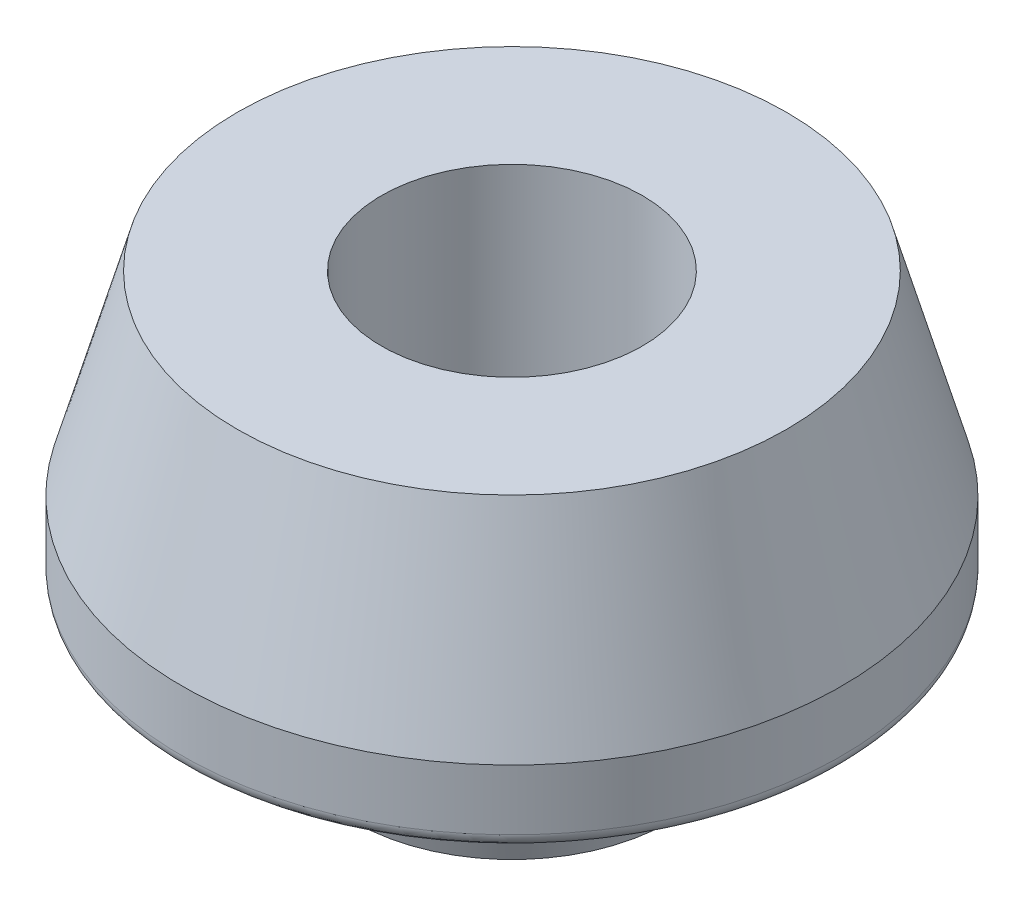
from build123d import *

# Parameters (mm, degrees)
FILLET1_R = 0.5


with BuildPart() as part:
    # Sketch1 → Revolve1 (revolve)
    with BuildSketch(Plane.XY, mode=Mode.PRIVATE) as revolve1_sk:
        Polygon((10, 0), (4.75, 0), (4.75, -14.5), (5.75, -14.5), (7, -9.8), (12, -9.8), (12, -7.1), align=None)
    revolve(revolve1_sk.sketch.rotate(Axis((0, -14.5, 0), (0, 1, 0)), 90), axis=Axis((0, -14.5, 0), (0, 1, 0)))

    # Fillet1
    fillet1_edges = [part.edges().sort_by_distance(p)[0] for p in [
        (0, -9.8, 12),
    ]]
    fillet(fillet1_edges, radius=FILLET1_R)


solid = part.part
